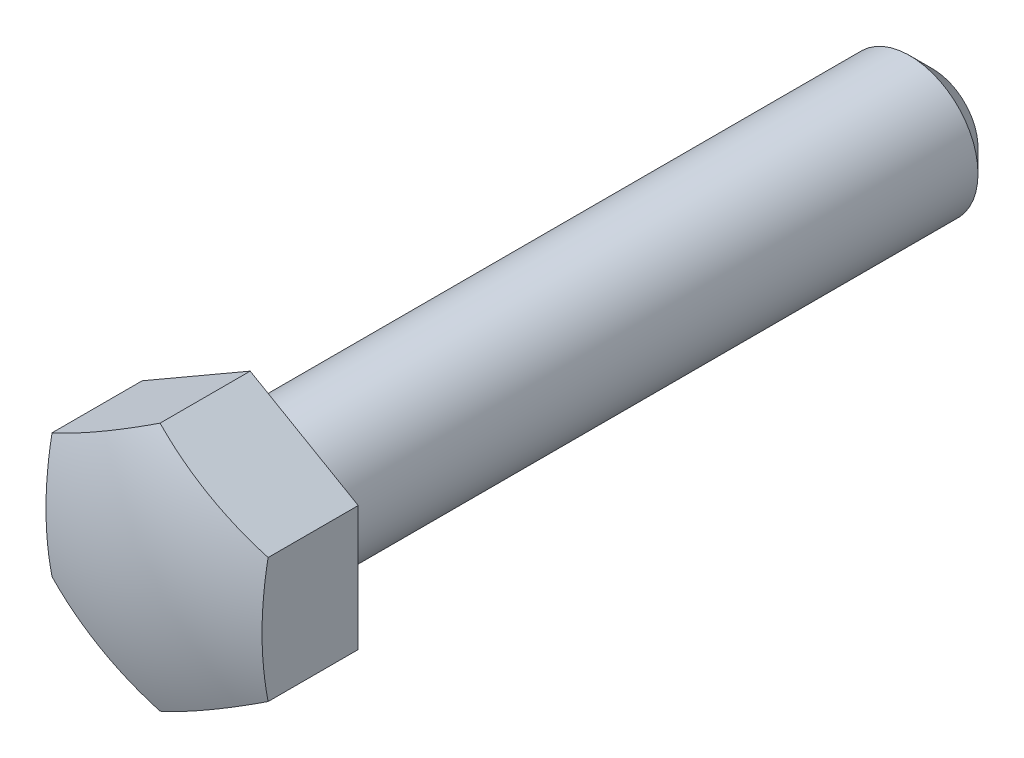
ISO-10303-21;
HEADER;
FILE_DESCRIPTION(('STEP AP214'),'2;1');
FILE_NAME('part.step','',(''),(''),'','','');
FILE_SCHEMA(('AUTOMOTIVE_DESIGN { 1 0 10303 214 1 1 1 1 }'));
ENDSEC;
DATA;
#1=APPLICATION_CONTEXT('core data for automotive mechanical design processes');
#2=APPLICATION_PROTOCOL_DEFINITION('international standard','automotive_design',2000,#1);
#3=PRODUCT_CONTEXT('',#1,'mechanical');
#4=PRODUCT('Part','Part','',(#3));
#5=PRODUCT_RELATED_PRODUCT_CATEGORY('part','',(#4));
#6=PRODUCT_DEFINITION_FORMATION('','',#4);
#7=PRODUCT_DEFINITION_CONTEXT('part definition',#1,'design');
#8=PRODUCT_DEFINITION('design','',#6,#7);
#9=PRODUCT_DEFINITION_SHAPE('','',#8);
#10=(LENGTH_UNIT() NAMED_UNIT(*) SI_UNIT(.MILLI.,.METRE.));
#11=(NAMED_UNIT(*) PLANE_ANGLE_UNIT() SI_UNIT($,.RADIAN.));
#12=(NAMED_UNIT(*) SI_UNIT($,.STERADIAN.) SOLID_ANGLE_UNIT());
#13=UNCERTAINTY_MEASURE_WITH_UNIT(LENGTH_MEASURE(1.E-05),#10,'distance_accuracy_value','');
#14=(GEOMETRIC_REPRESENTATION_CONTEXT(3) GLOBAL_UNCERTAINTY_ASSIGNED_CONTEXT((#13)) GLOBAL_UNIT_ASSIGNED_CONTEXT((#10,
#11,#12)) REPRESENTATION_CONTEXT('',''));
#15=CARTESIAN_POINT('',(0.,0.,0.));
#16=DIRECTION('',(0.,0.,1.));
#17=DIRECTION('',(1.,0.,0.));
#18=AXIS2_PLACEMENT_3D('',#15,#16,#17);
#19=CARTESIAN_POINT('',(6.,0.,0.));
#20=DIRECTION('',(0.,0.,1.));
#21=DIRECTION('',(1.,0.,0.));
#22=AXIS2_PLACEMENT_3D('',#19,#20,#21);
#23=PLANE('',#22);
#24=CARTESIAN_POINT('',(0.,0.,0.));
#25=DIRECTION('',(0.,0.,1.));
#26=DIRECTION('',(1.,0.,0.));
#27=AXIS2_PLACEMENT_3D('',#24,#25,#26);
#28=CIRCLE('',#27,6.);
#29=CARTESIAN_POINT('',(6.,0.,0.));
#30=VERTEX_POINT('',#29);
#31=EDGE_CURVE('E110',#30,#30,#28,.T.);
#32=ORIENTED_EDGE('',*,*,#31,.T.);
#33=EDGE_LOOP('',(#32));
#34=FACE_BOUND('',#33,.T.);
#35=DIRECTION('',(-0.86602540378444,-0.5,0.));
#36=VECTOR('',#35,1.);
#37=CARTESIAN_POINT('',(9.5,-5.48482755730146,0.));
#38=LINE('',#37,#36);
#39=CARTESIAN_POINT('',(9.5,-5.48482755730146,0.));
#40=VERTEX_POINT('',#39);
#41=CARTESIAN_POINT('',(0.,-10.9696551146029,0.));
#42=VERTEX_POINT('',#41);
#43=EDGE_CURVE('E107',#40,#42,#38,.T.);
#44=ORIENTED_EDGE('',*,*,#43,.T.);
#45=DIRECTION('',(0.86602540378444,-0.5,0.));
#46=VECTOR('',#45,1.);
#47=CARTESIAN_POINT('',(-9.5,-5.48482755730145,0.));
#48=LINE('',#47,#46);
#49=CARTESIAN_POINT('',(-9.5,-5.48482755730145,0.));
#50=VERTEX_POINT('',#49);
#51=EDGE_CURVE('E85',#50,#42,#48,.T.);
#52=ORIENTED_EDGE('',*,*,#51,.F.);
#53=DIRECTION('',(0.,-1.,0.));
#54=VECTOR('',#53,1.);
#55=CARTESIAN_POINT('',(-9.5,5.48482755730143,0.));
#56=LINE('',#55,#54);
#57=CARTESIAN_POINT('',(-9.5,5.48482755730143,0.));
#58=VERTEX_POINT('',#57);
#59=EDGE_CURVE('E62',#58,#50,#56,.T.);
#60=ORIENTED_EDGE('',*,*,#59,.F.);
#61=DIRECTION('',(0.866025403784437,0.5,0.));
#62=VECTOR('',#61,1.);
#63=CARTESIAN_POINT('',(-9.5,5.48482755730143,0.));
#64=LINE('',#63,#62);
#65=CARTESIAN_POINT('',(0.,10.9696551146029,0.));
#66=VERTEX_POINT('',#65);
#67=EDGE_CURVE('E109',#58,#66,#64,.T.);
#68=ORIENTED_EDGE('',*,*,#67,.T.);
#69=DIRECTION('',(-0.866025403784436,0.5,0.));
#70=VECTOR('',#69,1.);
#71=CARTESIAN_POINT('',(9.5,5.48482755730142,0.));
#72=LINE('',#71,#70);
#73=CARTESIAN_POINT('',(9.5,5.48482755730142,0.));
#74=VERTEX_POINT('',#73);
#75=EDGE_CURVE('E100',#74,#66,#72,.T.);
#76=ORIENTED_EDGE('',*,*,#75,.F.);
#77=DIRECTION('',(0.,-1.,0.));
#78=VECTOR('',#77,1.);
#79=CARTESIAN_POINT('',(9.5,5.48482755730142,0.));
#80=LINE('',#79,#78);
#81=EDGE_CURVE('E82',#74,#40,#80,.T.);
#82=ORIENTED_EDGE('',*,*,#81,.T.);
#83=EDGE_LOOP('',(#44,#52,#60,#68,#76,#82));
#84=FACE_BOUND('',#83,.T.);
#85=ADVANCED_FACE('F14',(#34,#84),#23,.F.);
#86=CARTESIAN_POINT('',(0.,0.,0.));
#87=DIRECTION('',(0.,0.,1.));
#88=DIRECTION('',(1.,0.,0.));
#89=AXIS2_PLACEMENT_3D('',#86,#87,#88);
#90=CYLINDRICAL_SURFACE('',#89,6.);
#91=CARTESIAN_POINT('',(0.,0.,-58.));
#92=DIRECTION('',(0.,0.,1.));
#93=DIRECTION('',(1.,0.,0.));
#94=AXIS2_PLACEMENT_3D('',#91,#92,#93);
#95=CIRCLE('',#94,6.);
#96=CARTESIAN_POINT('',(6.,0.,-58.));
#97=VERTEX_POINT('',#96);
#98=EDGE_CURVE('E23',#97,#97,#95,.T.);
#99=ORIENTED_EDGE('',*,*,#98,.T.);
#100=EDGE_LOOP('',(#99));
#101=FACE_BOUND('',#100,.T.);
#102=ORIENTED_EDGE('',*,*,#31,.F.);
#103=EDGE_LOOP('',(#102));
#104=FACE_BOUND('',#103,.T.);
#105=ADVANCED_FACE('F146',(#101,#104),#90,.T.);
#106=CARTESIAN_POINT('',(0.,0.,-60.));
#107=DIRECTION('',(0.,0.,1.));
#108=DIRECTION('',(1.,0.,0.));
#109=AXIS2_PLACEMENT_3D('',#106,#107,#108);
#110=PLANE('',#109);
#111=CARTESIAN_POINT('',(0.,0.,-60.));
#112=DIRECTION('',(0.,0.,1.));
#113=DIRECTION('',(1.,0.,0.));
#114=AXIS2_PLACEMENT_3D('',#111,#112,#113);
#115=CIRCLE('',#114,4.);
#116=CARTESIAN_POINT('',(4.,0.,-60.));
#117=VERTEX_POINT('',#116);
#118=EDGE_CURVE('E9',#117,#117,#115,.F.);
#119=ORIENTED_EDGE('',*,*,#118,.T.);
#120=EDGE_LOOP('',(#119));
#121=FACE_BOUND('',#120,.T.);
#122=ADVANCED_FACE('F152',(#121),#110,.F.);
#123=CARTESIAN_POINT('',(-9.5,-5.48482755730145,10.));
#124=DIRECTION('',(0.5,0.86602540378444,0.));
#125=DIRECTION('',(-0.86602540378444,0.5,0.));
#126=AXIS2_PLACEMENT_3D('',#123,#124,#125);
#127=PLANE('',#126);
#128=CARTESIAN_POINT('',(-4.75,-8.22724133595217,-20.));
#129=DIRECTION('',(0.5,0.86602540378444,0.));
#130=DIRECTION('',(-0.86602540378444,0.5,0.));
#131=AXIS2_PLACEMENT_3D('',#128,#129,#130);
#132=CIRCLE('',#131,28.4561065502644);
#133=CARTESIAN_POINT('',(0.,-10.9696551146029,7.9225118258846));
#134=VERTEX_POINT('',#133);
#135=CARTESIAN_POINT('',(-9.5,-5.48482755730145,7.9225118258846));
#136=VERTEX_POINT('',#135);
#137=EDGE_CURVE('E76',#134,#136,#132,.F.);
#138=ORIENTED_EDGE('',*,*,#137,.T.);
#139=DIRECTION('',(0.,0.,-1.));
#140=VECTOR('',#139,1.);
#141=CARTESIAN_POINT('',(-9.5,-5.48482755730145,10.));
#142=LINE('',#141,#140);
#143=EDGE_CURVE('E78',#136,#50,#142,.T.);
#144=ORIENTED_EDGE('',*,*,#143,.T.);
#145=ORIENTED_EDGE('',*,*,#51,.T.);
#146=DIRECTION('',(0.,0.,-1.));
#147=VECTOR('',#146,1.);
#148=CARTESIAN_POINT('',(0.,-10.9696551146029,10.));
#149=LINE('',#148,#147);
#150=EDGE_CURVE('E31',#134,#42,#149,.T.);
#151=ORIENTED_EDGE('',*,*,#150,.F.);
#152=EDGE_LOOP('',(#138,#144,#145,#151));
#153=FACE_BOUND('',#152,.T.);
#154=ADVANCED_FACE('F77',(#153),#127,.F.);
#155=CARTESIAN_POINT('',(-9.5,5.48482755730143,10.));
#156=DIRECTION('',(1.,0.,0.));
#157=DIRECTION('',(0.,1.,0.));
#158=AXIS2_PLACEMENT_3D('',#155,#156,#157);
#159=PLANE('',#158);
#160=CARTESIAN_POINT('',(-9.5,0.,-20.));
#161=DIRECTION('',(1.,0.,0.));
#162=DIRECTION('',(0.,1.,0.));
#163=AXIS2_PLACEMENT_3D('',#160,#161,#162);
#164=CIRCLE('',#163,28.4561065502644);
#165=CARTESIAN_POINT('',(-9.5,5.48482755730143,7.9225118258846));
#166=VERTEX_POINT('',#165);
#167=EDGE_CURVE('E71',#136,#166,#164,.F.);
#168=ORIENTED_EDGE('',*,*,#167,.T.);
#169=DIRECTION('',(0.,0.,-1.));
#170=VECTOR('',#169,1.);
#171=CARTESIAN_POINT('',(-9.5,5.48482755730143,10.));
#172=LINE('',#171,#170);
#173=EDGE_CURVE('E91',#166,#58,#172,.T.);
#174=ORIENTED_EDGE('',*,*,#173,.T.);
#175=ORIENTED_EDGE('',*,*,#59,.T.);
#176=ORIENTED_EDGE('',*,*,#143,.F.);
#177=EDGE_LOOP('',(#168,#174,#175,#176));
#178=FACE_BOUND('',#177,.T.);
#179=ADVANCED_FACE('F84',(#178),#159,.F.);
#180=CARTESIAN_POINT('',(-9.5,5.48482755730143,10.));
#181=DIRECTION('',(-0.5,0.866025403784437,0.));
#182=DIRECTION('',(-0.866025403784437,-0.5,0.));
#183=AXIS2_PLACEMENT_3D('',#180,#181,#182);
#184=PLANE('',#183);
#185=DIRECTION('',(0.,0.,-1.));
#186=VECTOR('',#185,1.);
#187=CARTESIAN_POINT('',(0.,10.9696551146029,10.));
#188=LINE('',#187,#186);
#189=CARTESIAN_POINT('',(0.,10.9696551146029,7.9225118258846));
#190=VERTEX_POINT('',#189);
#191=EDGE_CURVE('E53',#190,#66,#188,.T.);
#192=ORIENTED_EDGE('',*,*,#191,.T.);
#193=ORIENTED_EDGE('',*,*,#67,.F.);
#194=ORIENTED_EDGE('',*,*,#173,.F.);
#195=CARTESIAN_POINT('',(-4.75,8.22724133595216,-20.));
#196=DIRECTION('',(-0.5,0.866025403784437,0.));
#197=DIRECTION('',(-0.866025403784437,-0.5,0.));
#198=AXIS2_PLACEMENT_3D('',#195,#196,#197);
#199=CIRCLE('',#198,28.4561065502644);
#200=EDGE_CURVE('E90',#190,#166,#199,.F.);
#201=ORIENTED_EDGE('',*,*,#200,.F.);
#202=EDGE_LOOP('',(#192,#193,#194,#201));
#203=FACE_BOUND('',#202,.T.);
#204=ADVANCED_FACE('F134',(#203),#184,.T.);
#205=CARTESIAN_POINT('',(9.5,5.48482755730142,10.));
#206=DIRECTION('',(-0.5,-0.866025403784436,0.));
#207=DIRECTION('',(0.866025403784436,-0.5,0.));
#208=AXIS2_PLACEMENT_3D('',#205,#206,#207);
#209=PLANE('',#208);
#210=CARTESIAN_POINT('',(4.75,8.22724133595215,-20.));
#211=DIRECTION('',(-0.5,-0.866025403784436,0.));
#212=DIRECTION('',(0.866025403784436,-0.5,0.));
#213=AXIS2_PLACEMENT_3D('',#210,#211,#212);
#214=CIRCLE('',#213,28.4561065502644);
#215=CARTESIAN_POINT('',(9.5,5.48482755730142,7.9225118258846));
#216=VERTEX_POINT('',#215);
#217=EDGE_CURVE('E103',#190,#216,#214,.F.);
#218=ORIENTED_EDGE('',*,*,#217,.T.);
#219=DIRECTION('',(0.,0.,-1.));
#220=VECTOR('',#219,1.);
#221=CARTESIAN_POINT('',(9.5,5.48482755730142,10.));
#222=LINE('',#221,#220);
#223=EDGE_CURVE('E101',#216,#74,#222,.T.);
#224=ORIENTED_EDGE('',*,*,#223,.T.);
#225=ORIENTED_EDGE('',*,*,#75,.T.);
#226=ORIENTED_EDGE('',*,*,#191,.F.);
#227=EDGE_LOOP('',(#218,#224,#225,#226));
#228=FACE_BOUND('',#227,.T.);
#229=ADVANCED_FACE('F127',(#228),#209,.F.);
#230=CARTESIAN_POINT('',(9.5,5.48482755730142,10.));
#231=DIRECTION('',(1.,0.,0.));
#232=DIRECTION('',(0.,1.,0.));
#233=AXIS2_PLACEMENT_3D('',#230,#231,#232);
#234=PLANE('',#233);
#235=DIRECTION('',(0.,0.,-1.));
#236=VECTOR('',#235,1.);
#237=CARTESIAN_POINT('',(9.5,-5.48482755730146,10.));
#238=LINE('',#237,#236);
#239=CARTESIAN_POINT('',(9.5,-5.48482755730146,7.9225118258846));
#240=VERTEX_POINT('',#239);
#241=EDGE_CURVE('E98',#240,#40,#238,.T.);
#242=ORIENTED_EDGE('',*,*,#241,.T.);
#243=ORIENTED_EDGE('',*,*,#81,.F.);
#244=ORIENTED_EDGE('',*,*,#223,.F.);
#245=CARTESIAN_POINT('',(9.5,0.,-20.));
#246=DIRECTION('',(1.,0.,0.));
#247=DIRECTION('',(0.,1.,0.));
#248=AXIS2_PLACEMENT_3D('',#245,#246,#247);
#249=CIRCLE('',#248,28.4561065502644);
#250=EDGE_CURVE('E120',#240,#216,#249,.F.);
#251=ORIENTED_EDGE('',*,*,#250,.F.);
#252=EDGE_LOOP('',(#242,#243,#244,#251));
#253=FACE_BOUND('',#252,.T.);
#254=ADVANCED_FACE('F130',(#253),#234,.T.);
#255=CARTESIAN_POINT('',(9.5,-5.48482755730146,10.));
#256=DIRECTION('',(0.5,-0.86602540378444,0.));
#257=DIRECTION('',(0.86602540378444,0.5,0.));
#258=AXIS2_PLACEMENT_3D('',#255,#256,#257);
#259=PLANE('',#258);
#260=ORIENTED_EDGE('',*,*,#150,.T.);
#261=ORIENTED_EDGE('',*,*,#43,.F.);
#262=ORIENTED_EDGE('',*,*,#241,.F.);
#263=CARTESIAN_POINT('',(4.75,-8.22724133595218,-20.));
#264=DIRECTION('',(0.5,-0.86602540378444,0.));
#265=DIRECTION('',(0.86602540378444,0.5,0.));
#266=AXIS2_PLACEMENT_3D('',#263,#264,#265);
#267=CIRCLE('',#266,28.4561065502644);
#268=EDGE_CURVE('E106',#134,#240,#267,.F.);
#269=ORIENTED_EDGE('',*,*,#268,.F.);
#270=EDGE_LOOP('',(#260,#261,#262,#269));
#271=FACE_BOUND('',#270,.T.);
#272=ADVANCED_FACE('F158',(#271),#259,.T.);
#273=CARTESIAN_POINT('',(0.,0.,-20.));
#274=DIRECTION('',(0.,0.,1.));
#275=DIRECTION('',(1.,0.,0.));
#276=AXIS2_PLACEMENT_3D('',#273,#274,#275);
#277=SPHERICAL_SURFACE('',#276,30.);
#278=ORIENTED_EDGE('',*,*,#137,.F.);
#279=ORIENTED_EDGE('',*,*,#268,.T.);
#280=ORIENTED_EDGE('',*,*,#250,.T.);
#281=ORIENTED_EDGE('',*,*,#217,.F.);
#282=ORIENTED_EDGE('',*,*,#200,.T.);
#283=ORIENTED_EDGE('',*,*,#167,.F.);
#284=EDGE_LOOP('',(#278,#279,#280,#281,#282,#283));
#285=FACE_BOUND('',#284,.T.);
#286=ADVANCED_FACE('F88',(#285),#277,.T.);
#287=CARTESIAN_POINT('',(0.,0.,-58.));
#288=DIRECTION('',(0.,0.,1.));
#289=DIRECTION('',(1.,0.,0.));
#290=AXIS2_PLACEMENT_3D('',#287,#288,#289);
#291=CONICAL_SURFACE('',#290,6.,0.78539816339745);
#292=ORIENTED_EDGE('',*,*,#118,.F.);
#293=EDGE_LOOP('',(#292));
#294=FACE_BOUND('',#293,.T.);
#295=ORIENTED_EDGE('',*,*,#98,.F.);
#296=EDGE_LOOP('',(#295));
#297=FACE_BOUND('',#296,.T.);
#298=ADVANCED_FACE('F16',(#294,#297),#291,.T.);
#299=CLOSED_SHELL('',(#85,#105,#122,#154,#179,#204,#229,#254,#272,#286,#298));
#300=MANIFOLD_SOLID_BREP('B1',#299);
#301=ADVANCED_BREP_SHAPE_REPRESENTATION('',(#18,#300),#14);
#302=SHAPE_DEFINITION_REPRESENTATION(#9,#301);
ENDSEC;
END-ISO-10303-21;
